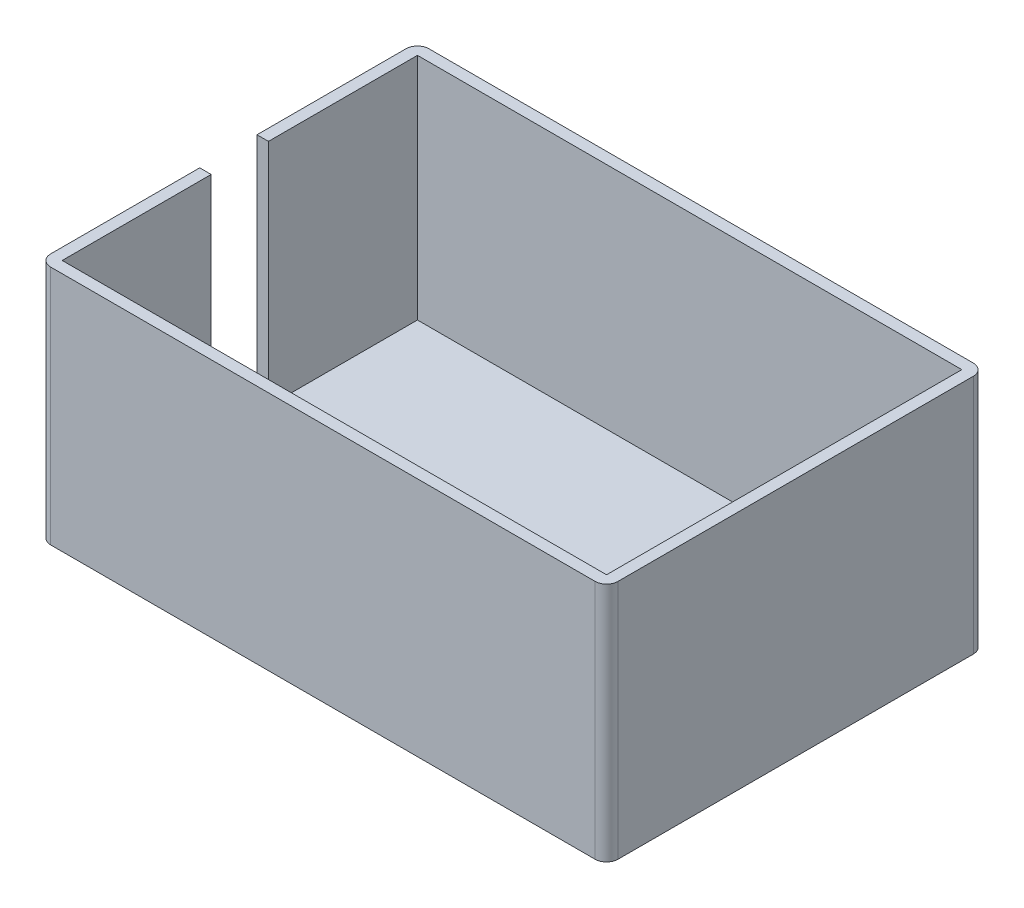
ISO-10303-21;
HEADER;
FILE_DESCRIPTION(('STEP AP214'),'2;1');
FILE_NAME('part.step','',(''),(''),'','','');
FILE_SCHEMA(('AUTOMOTIVE_DESIGN { 1 0 10303 214 1 1 1 1 }'));
ENDSEC;
DATA;
#1=APPLICATION_CONTEXT('core data for automotive mechanical design processes');
#2=APPLICATION_PROTOCOL_DEFINITION('international standard','automotive_design',2000,#1);
#3=PRODUCT_CONTEXT('',#1,'mechanical');
#4=PRODUCT('Part','Part','',(#3));
#5=PRODUCT_RELATED_PRODUCT_CATEGORY('part','',(#4));
#6=PRODUCT_DEFINITION_FORMATION('','',#4);
#7=PRODUCT_DEFINITION_CONTEXT('part definition',#1,'design');
#8=PRODUCT_DEFINITION('design','',#6,#7);
#9=PRODUCT_DEFINITION_SHAPE('','',#8);
#10=(LENGTH_UNIT() NAMED_UNIT(*) SI_UNIT(.MILLI.,.METRE.));
#11=(NAMED_UNIT(*) PLANE_ANGLE_UNIT() SI_UNIT($,.RADIAN.));
#12=(NAMED_UNIT(*) SI_UNIT($,.STERADIAN.) SOLID_ANGLE_UNIT());
#13=UNCERTAINTY_MEASURE_WITH_UNIT(LENGTH_MEASURE(1.E-05),#10,'distance_accuracy_value','');
#14=(GEOMETRIC_REPRESENTATION_CONTEXT(3) GLOBAL_UNCERTAINTY_ASSIGNED_CONTEXT((#13)) GLOBAL_UNIT_ASSIGNED_CONTEXT((#10,
#11,#12)) REPRESENTATION_CONTEXT('',''));
#15=CARTESIAN_POINT('',(0.,0.,0.));
#16=DIRECTION('',(0.,0.,1.));
#17=DIRECTION('',(1.,0.,0.));
#18=AXIS2_PLACEMENT_3D('',#15,#16,#17);
#19=CARTESIAN_POINT('',(-49.5,21.,-66.));
#20=DIRECTION('',(0.,1.,0.));
#21=DIRECTION('',(0.,0.,1.));
#22=AXIS2_PLACEMENT_3D('',#19,#20,#21);
#23=PLANE('',#22);
#24=DIRECTION('',(-1.,0.,0.));
#25=VECTOR('',#24,1.);
#26=CARTESIAN_POINT('',(-49.5,21.,-66.));
#27=LINE('',#26,#25);
#28=CARTESIAN_POINT('',(47.5,21.,-66.));
#29=VERTEX_POINT('',#28);
#30=CARTESIAN_POINT('',(-47.5,21.,-66.));
#31=VERTEX_POINT('',#30);
#32=EDGE_CURVE('E188',#29,#31,#27,.T.);
#33=ORIENTED_EDGE('',*,*,#32,.T.);
#34=CARTESIAN_POINT('',(-47.5,21.,-64.));
#35=DIRECTION('',(0.,1.,0.));
#36=DIRECTION('',(0.,0.,1.));
#37=AXIS2_PLACEMENT_3D('',#34,#35,#36);
#38=CIRCLE('',#37,2.);
#39=CARTESIAN_POINT('',(-49.5,21.,-64.));
#40=VERTEX_POINT('',#39);
#41=EDGE_CURVE('E216',#31,#40,#38,.T.);
#42=ORIENTED_EDGE('',*,*,#41,.T.);
#43=DIRECTION('',(0.,0.,1.));
#44=VECTOR('',#43,1.);
#45=CARTESIAN_POINT('',(-49.5,21.,-66.));
#46=LINE('',#45,#44);
#47=CARTESIAN_POINT('',(-49.5,21.,-38.));
#48=VERTEX_POINT('',#47);
#49=EDGE_CURVE('E174',#40,#48,#46,.T.);
#50=ORIENTED_EDGE('',*,*,#49,.T.);
#51=DIRECTION('',(-1.,0.,0.));
#52=VECTOR('',#51,1.);
#53=CARTESIAN_POINT('',(-39.5,21.,-38.));
#54=LINE('',#53,#52);
#55=CARTESIAN_POINT('',(-47.5,21.,-38.));
#56=VERTEX_POINT('',#55);
#57=EDGE_CURVE('E273',#56,#48,#54,.T.);
#58=ORIENTED_EDGE('',*,*,#57,.F.);
#59=DIRECTION('',(0.,0.,1.));
#60=VECTOR('',#59,1.);
#61=CARTESIAN_POINT('',(-47.5,21.,-66.));
#62=LINE('',#61,#60);
#63=CARTESIAN_POINT('',(-47.5,21.,-64.));
#64=VERTEX_POINT('',#63);
#65=EDGE_CURVE('E235',#64,#56,#62,.T.);
#66=ORIENTED_EDGE('',*,*,#65,.F.);
#67=DIRECTION('',(-1.,0.,0.));
#68=VECTOR('',#67,1.);
#69=CARTESIAN_POINT('',(0.,21.,-64.));
#70=LINE('',#69,#68);
#71=CARTESIAN_POINT('',(47.5,21.,-64.));
#72=VERTEX_POINT('',#71);
#73=EDGE_CURVE('E243',#72,#64,#70,.T.);
#74=ORIENTED_EDGE('',*,*,#73,.F.);
#75=DIRECTION('',(0.,0.,1.));
#76=VECTOR('',#75,1.);
#77=CARTESIAN_POINT('',(47.5,21.,-66.));
#78=LINE('',#77,#76);
#79=CARTESIAN_POINT('',(47.5,21.,-2.));
#80=VERTEX_POINT('',#79);
#81=EDGE_CURVE('E247',#72,#80,#78,.T.);
#82=ORIENTED_EDGE('',*,*,#81,.T.);
#83=DIRECTION('',(-1.,0.,0.));
#84=VECTOR('',#83,1.);
#85=CARTESIAN_POINT('',(0.,21.,-2.));
#86=LINE('',#85,#84);
#87=CARTESIAN_POINT('',(-47.5,21.,-2.));
#88=VERTEX_POINT('',#87);
#89=EDGE_CURVE('E251',#80,#88,#86,.T.);
#90=ORIENTED_EDGE('',*,*,#89,.T.);
#91=CARTESIAN_POINT('',(-47.5,21.,-28.));
#92=VERTEX_POINT('',#91);
#93=EDGE_CURVE('E166',#92,#88,#62,.T.);
#94=ORIENTED_EDGE('',*,*,#93,.F.);
#95=DIRECTION('',(-1.,0.,0.));
#96=VECTOR('',#95,1.);
#97=CARTESIAN_POINT('',(-39.5,21.,-28.));
#98=LINE('',#97,#96);
#99=CARTESIAN_POINT('',(-49.5,21.,-28.));
#100=VERTEX_POINT('',#99);
#101=EDGE_CURVE('E150',#92,#100,#98,.T.);
#102=ORIENTED_EDGE('',*,*,#101,.T.);
#103=CARTESIAN_POINT('',(-49.5,21.,-2.));
#104=VERTEX_POINT('',#103);
#105=EDGE_CURVE('E163',#100,#104,#46,.T.);
#106=ORIENTED_EDGE('',*,*,#105,.T.);
#107=CARTESIAN_POINT('',(-47.5,21.,-2.));
#108=DIRECTION('',(0.,1.,0.));
#109=DIRECTION('',(0.,0.,1.));
#110=AXIS2_PLACEMENT_3D('',#107,#108,#109);
#111=CIRCLE('',#110,2.);
#112=CARTESIAN_POINT('',(-47.5,21.,0.));
#113=VERTEX_POINT('',#112);
#114=EDGE_CURVE('E212',#104,#113,#111,.T.);
#115=ORIENTED_EDGE('',*,*,#114,.T.);
#116=DIRECTION('',(-1.,0.,0.));
#117=VECTOR('',#116,1.);
#118=CARTESIAN_POINT('',(-49.5,21.,0.));
#119=LINE('',#118,#117);
#120=CARTESIAN_POINT('',(47.5,21.,0.));
#121=VERTEX_POINT('',#120);
#122=EDGE_CURVE('E181',#121,#113,#119,.T.);
#123=ORIENTED_EDGE('',*,*,#122,.F.);
#124=CARTESIAN_POINT('',(47.5,21.,-2.));
#125=DIRECTION('',(0.,1.,0.));
#126=DIRECTION('',(0.,0.,1.));
#127=AXIS2_PLACEMENT_3D('',#124,#125,#126);
#128=CIRCLE('',#127,2.);
#129=CARTESIAN_POINT('',(49.5,21.,-2.));
#130=VERTEX_POINT('',#129);
#131=EDGE_CURVE('E48',#121,#130,#128,.T.);
#132=ORIENTED_EDGE('',*,*,#131,.T.);
#133=DIRECTION('',(0.,0.,1.));
#134=VECTOR('',#133,1.);
#135=CARTESIAN_POINT('',(49.5,21.,-66.));
#136=LINE('',#135,#134);
#137=CARTESIAN_POINT('',(49.5,21.,-64.));
#138=VERTEX_POINT('',#137);
#139=EDGE_CURVE('E175',#138,#130,#136,.T.);
#140=ORIENTED_EDGE('',*,*,#139,.F.);
#141=CARTESIAN_POINT('',(47.5,21.,-64.));
#142=DIRECTION('',(0.,1.,0.));
#143=DIRECTION('',(0.,0.,1.));
#144=AXIS2_PLACEMENT_3D('',#141,#142,#143);
#145=CIRCLE('',#144,2.);
#146=EDGE_CURVE('E56',#138,#29,#145,.T.);
#147=ORIENTED_EDGE('',*,*,#146,.T.);
#148=EDGE_LOOP('',(#33,#42,#50,#58,#66,#74,#82,#90,#94,#102,#106,#115,#123,#132,#140,#147));
#149=FACE_BOUND('',#148,.T.);
#150=ADVANCED_FACE('F33',(#149),#23,.T.);
#151=CARTESIAN_POINT('',(-49.5,21.,-66.));
#152=DIRECTION('',(-1.,0.,0.));
#153=DIRECTION('',(0.,0.,1.));
#154=AXIS2_PLACEMENT_3D('',#151,#152,#153);
#155=PLANE('',#154);
#156=ORIENTED_EDGE('',*,*,#49,.F.);
#157=DIRECTION('',(0.,-1.,0.));
#158=VECTOR('',#157,1.);
#159=CARTESIAN_POINT('',(-49.5,-21.,-64.));
#160=LINE('',#159,#158);
#161=CARTESIAN_POINT('',(-49.5,-21.,-64.));
#162=VERTEX_POINT('',#161);
#163=EDGE_CURVE('E197',#40,#162,#160,.T.);
#164=ORIENTED_EDGE('',*,*,#163,.T.);
#165=DIRECTION('',(0.,0.,1.));
#166=VECTOR('',#165,1.);
#167=CARTESIAN_POINT('',(-49.5,-21.,-66.));
#168=LINE('',#167,#166);
#169=CARTESIAN_POINT('',(-49.5,-21.,-2.));
#170=VERTEX_POINT('',#169);
#171=EDGE_CURVE('E186',#162,#170,#168,.T.);
#172=ORIENTED_EDGE('',*,*,#171,.T.);
#173=DIRECTION('',(0.,-1.,0.));
#174=VECTOR('',#173,1.);
#175=CARTESIAN_POINT('',(-49.5,21.,-2.));
#176=LINE('',#175,#174);
#177=EDGE_CURVE('E173',#170,#104,#176,.F.);
#178=ORIENTED_EDGE('',*,*,#177,.T.);
#179=ORIENTED_EDGE('',*,*,#105,.F.);
#180=DIRECTION('',(0.,-1.,0.));
#181=VECTOR('',#180,1.);
#182=CARTESIAN_POINT('',(-49.5,21.,-28.));
#183=LINE('',#182,#181);
#184=CARTESIAN_POINT('',(-49.5,-18.5619536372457,-28.));
#185=VERTEX_POINT('',#184);
#186=EDGE_CURVE('E147',#100,#185,#183,.T.);
#187=ORIENTED_EDGE('',*,*,#186,.T.);
#188=DIRECTION('',(0.,0.,1.));
#189=VECTOR('',#188,1.);
#190=CARTESIAN_POINT('',(-49.5,-18.5619536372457,-38.));
#191=LINE('',#190,#189);
#192=CARTESIAN_POINT('',(-49.5,-18.5619536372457,-38.));
#193=VERTEX_POINT('',#192);
#194=EDGE_CURVE('E158',#193,#185,#191,.T.);
#195=ORIENTED_EDGE('',*,*,#194,.F.);
#196=DIRECTION('',(0.,-1.,0.));
#197=VECTOR('',#196,1.);
#198=CARTESIAN_POINT('',(-49.5,21.,-38.));
#199=LINE('',#198,#197);
#200=EDGE_CURVE('E276',#48,#193,#199,.T.);
#201=ORIENTED_EDGE('',*,*,#200,.F.);
#202=EDGE_LOOP('',(#156,#164,#172,#178,#179,#187,#195,#201));
#203=FACE_BOUND('',#202,.T.);
#204=ADVANCED_FACE('F170',(#203),#155,.T.);
#205=CARTESIAN_POINT('',(-47.5,21.,-66.));
#206=DIRECTION('',(-1.,0.,0.));
#207=DIRECTION('',(0.,0.,1.));
#208=AXIS2_PLACEMENT_3D('',#205,#206,#207);
#209=PLANE('',#208);
#210=DIRECTION('',(0.,-1.,0.));
#211=VECTOR('',#210,1.);
#212=CARTESIAN_POINT('',(-47.5,21.,-28.));
#213=LINE('',#212,#211);
#214=CARTESIAN_POINT('',(-47.5,-18.5619536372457,-28.));
#215=VERTEX_POINT('',#214);
#216=EDGE_CURVE('E194',#92,#215,#213,.T.);
#217=ORIENTED_EDGE('',*,*,#216,.F.);
#218=ORIENTED_EDGE('',*,*,#93,.T.);
#219=DIRECTION('',(0.,-1.,0.));
#220=VECTOR('',#219,1.);
#221=CARTESIAN_POINT('',(-47.5,0.,-2.));
#222=LINE('',#221,#220);
#223=CARTESIAN_POINT('',(-47.5,-19.,-2.));
#224=VERTEX_POINT('',#223);
#225=EDGE_CURVE('E167',#88,#224,#222,.T.);
#226=ORIENTED_EDGE('',*,*,#225,.T.);
#227=DIRECTION('',(0.,0.,1.));
#228=VECTOR('',#227,1.);
#229=CARTESIAN_POINT('',(-47.5,-19.,-66.));
#230=LINE('',#229,#228);
#231=CARTESIAN_POINT('',(-47.5,-19.,-64.));
#232=VERTEX_POINT('',#231);
#233=EDGE_CURVE('E245',#232,#224,#230,.T.);
#234=ORIENTED_EDGE('',*,*,#233,.F.);
#235=DIRECTION('',(0.,-1.,0.));
#236=VECTOR('',#235,1.);
#237=CARTESIAN_POINT('',(-47.5,0.,-64.));
#238=LINE('',#237,#236);
#239=EDGE_CURVE('E252',#64,#232,#238,.T.);
#240=ORIENTED_EDGE('',*,*,#239,.F.);
#241=ORIENTED_EDGE('',*,*,#65,.T.);
#242=DIRECTION('',(0.,-1.,0.));
#243=VECTOR('',#242,1.);
#244=CARTESIAN_POINT('',(-47.5,21.,-38.));
#245=LINE('',#244,#243);
#246=CARTESIAN_POINT('',(-47.5,-18.5619536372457,-38.));
#247=VERTEX_POINT('',#246);
#248=EDGE_CURVE('E177',#56,#247,#245,.T.);
#249=ORIENTED_EDGE('',*,*,#248,.T.);
#250=DIRECTION('',(0.,0.,1.));
#251=VECTOR('',#250,1.);
#252=CARTESIAN_POINT('',(-47.5,-18.5619536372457,-66.));
#253=LINE('',#252,#251);
#254=EDGE_CURVE('E191',#247,#215,#253,.T.);
#255=ORIENTED_EDGE('',*,*,#254,.T.);
#256=EDGE_LOOP('',(#217,#218,#226,#234,#240,#241,#249,#255));
#257=FACE_BOUND('',#256,.T.);
#258=ADVANCED_FACE('F291',(#257),#209,.F.);
#259=CARTESIAN_POINT('',(49.5,21.,-66.));
#260=DIRECTION('',(1.,0.,0.));
#261=DIRECTION('',(0.,0.,-1.));
#262=AXIS2_PLACEMENT_3D('',#259,#260,#261);
#263=PLANE('',#262);
#264=DIRECTION('',(0.,0.,1.));
#265=VECTOR('',#264,1.);
#266=CARTESIAN_POINT('',(49.5,-21.,-66.));
#267=LINE('',#266,#265);
#268=CARTESIAN_POINT('',(49.5,-21.,-64.));
#269=VERTEX_POINT('',#268);
#270=CARTESIAN_POINT('',(49.5,-21.,-2.));
#271=VERTEX_POINT('',#270);
#272=EDGE_CURVE('E178',#269,#271,#267,.T.);
#273=ORIENTED_EDGE('',*,*,#272,.F.);
#274=DIRECTION('',(0.,1.,0.));
#275=VECTOR('',#274,1.);
#276=CARTESIAN_POINT('',(49.5,21.,-64.));
#277=LINE('',#276,#275);
#278=EDGE_CURVE('E220',#269,#138,#277,.T.);
#279=ORIENTED_EDGE('',*,*,#278,.T.);
#280=ORIENTED_EDGE('',*,*,#139,.T.);
#281=DIRECTION('',(0.,1.,0.));
#282=VECTOR('',#281,1.);
#283=CARTESIAN_POINT('',(49.5,21.,-2.));
#284=LINE('',#283,#282);
#285=EDGE_CURVE('E218',#130,#271,#284,.F.);
#286=ORIENTED_EDGE('',*,*,#285,.T.);
#287=EDGE_LOOP('',(#273,#279,#280,#286));
#288=FACE_BOUND('',#287,.T.);
#289=ADVANCED_FACE('F323',(#288),#263,.T.);
#290=CARTESIAN_POINT('',(-49.5,-21.,-66.));
#291=DIRECTION('',(0.,-1.,0.));
#292=DIRECTION('',(0.,0.,-1.));
#293=AXIS2_PLACEMENT_3D('',#290,#291,#292);
#294=PLANE('',#293);
#295=ORIENTED_EDGE('',*,*,#171,.F.);
#296=CARTESIAN_POINT('',(-47.5,-21.,-64.));
#297=DIRECTION('',(0.,-1.,0.));
#298=DIRECTION('',(0.,0.,-1.));
#299=AXIS2_PLACEMENT_3D('',#296,#297,#298);
#300=CIRCLE('',#299,2.);
#301=CARTESIAN_POINT('',(-47.5,-21.,-66.));
#302=VERTEX_POINT('',#301);
#303=EDGE_CURVE('E206',#162,#302,#300,.T.);
#304=ORIENTED_EDGE('',*,*,#303,.T.);
#305=DIRECTION('',(1.,0.,0.));
#306=VECTOR('',#305,1.);
#307=CARTESIAN_POINT('',(-49.5,-21.,-66.));
#308=LINE('',#307,#306);
#309=CARTESIAN_POINT('',(47.5,-21.,-66.));
#310=VERTEX_POINT('',#309);
#311=EDGE_CURVE('E236',#302,#310,#308,.T.);
#312=ORIENTED_EDGE('',*,*,#311,.T.);
#313=CARTESIAN_POINT('',(47.5,-21.,-64.));
#314=DIRECTION('',(0.,-1.,0.));
#315=DIRECTION('',(0.,0.,-1.));
#316=AXIS2_PLACEMENT_3D('',#313,#314,#315);
#317=CIRCLE('',#316,2.);
#318=EDGE_CURVE('E204',#310,#269,#317,.T.);
#319=ORIENTED_EDGE('',*,*,#318,.T.);
#320=ORIENTED_EDGE('',*,*,#272,.T.);
#321=CARTESIAN_POINT('',(47.5,-21.,-2.));
#322=DIRECTION('',(0.,-1.,0.));
#323=DIRECTION('',(0.,0.,-1.));
#324=AXIS2_PLACEMENT_3D('',#321,#322,#323);
#325=CIRCLE('',#324,2.);
#326=CARTESIAN_POINT('',(47.5,-21.,0.));
#327=VERTEX_POINT('',#326);
#328=EDGE_CURVE('E202',#271,#327,#325,.T.);
#329=ORIENTED_EDGE('',*,*,#328,.T.);
#330=DIRECTION('',(1.,0.,0.));
#331=VECTOR('',#330,1.);
#332=CARTESIAN_POINT('',(-49.5,-21.,0.));
#333=LINE('',#332,#331);
#334=CARTESIAN_POINT('',(-47.5,-21.,0.));
#335=VERTEX_POINT('',#334);
#336=EDGE_CURVE('E228',#335,#327,#333,.T.);
#337=ORIENTED_EDGE('',*,*,#336,.F.);
#338=CARTESIAN_POINT('',(-47.5,-21.,-2.));
#339=DIRECTION('',(0.,-1.,0.));
#340=DIRECTION('',(0.,0.,-1.));
#341=AXIS2_PLACEMENT_3D('',#338,#339,#340);
#342=CIRCLE('',#341,2.);
#343=EDGE_CURVE('E200',#335,#170,#342,.T.);
#344=ORIENTED_EDGE('',*,*,#343,.T.);
#345=EDGE_LOOP('',(#295,#304,#312,#319,#320,#329,#337,#344));
#346=FACE_BOUND('',#345,.T.);
#347=ADVANCED_FACE('F233',(#346),#294,.T.);
#348=CARTESIAN_POINT('',(0.,0.,-66.));
#349=DIRECTION('',(0.,0.,1.));
#350=DIRECTION('',(1.,0.,0.));
#351=AXIS2_PLACEMENT_3D('',#348,#349,#350);
#352=PLANE('',#351);
#353=ORIENTED_EDGE('',*,*,#311,.F.);
#354=DIRECTION('',(0.,-1.,0.));
#355=VECTOR('',#354,1.);
#356=CARTESIAN_POINT('',(-47.5,21.,-66.));
#357=LINE('',#356,#355);
#358=EDGE_CURVE('E210',#302,#31,#357,.F.);
#359=ORIENTED_EDGE('',*,*,#358,.T.);
#360=ORIENTED_EDGE('',*,*,#32,.F.);
#361=DIRECTION('',(0.,1.,0.));
#362=VECTOR('',#361,1.);
#363=CARTESIAN_POINT('',(47.5,-21.,-66.));
#364=LINE('',#363,#362);
#365=EDGE_CURVE('E208',#29,#310,#364,.F.);
#366=ORIENTED_EDGE('',*,*,#365,.T.);
#367=EDGE_LOOP('',(#353,#359,#360,#366));
#368=FACE_BOUND('',#367,.T.);
#369=ADVANCED_FACE('F328',(#368),#352,.F.);
#370=CARTESIAN_POINT('',(0.,0.,0.));
#371=DIRECTION('',(0.,0.,1.));
#372=DIRECTION('',(1.,0.,0.));
#373=AXIS2_PLACEMENT_3D('',#370,#371,#372);
#374=PLANE('',#373);
#375=ORIENTED_EDGE('',*,*,#336,.T.);
#376=DIRECTION('',(0.,1.,0.));
#377=VECTOR('',#376,1.);
#378=CARTESIAN_POINT('',(47.5,0.,0.));
#379=LINE('',#378,#377);
#380=EDGE_CURVE('E11',#327,#121,#379,.T.);
#381=ORIENTED_EDGE('',*,*,#380,.T.);
#382=ORIENTED_EDGE('',*,*,#122,.T.);
#383=DIRECTION('',(0.,-1.,0.));
#384=VECTOR('',#383,1.);
#385=CARTESIAN_POINT('',(-47.5,0.,0.));
#386=LINE('',#385,#384);
#387=EDGE_CURVE('E41',#113,#335,#386,.T.);
#388=ORIENTED_EDGE('',*,*,#387,.T.);
#389=EDGE_LOOP('',(#375,#381,#382,#388));
#390=FACE_BOUND('',#389,.T.);
#391=ADVANCED_FACE('F227',(#390),#374,.T.);
#392=CARTESIAN_POINT('',(47.5,21.,-66.));
#393=DIRECTION('',(1.,0.,0.));
#394=DIRECTION('',(0.,0.,-1.));
#395=AXIS2_PLACEMENT_3D('',#392,#393,#394);
#396=PLANE('',#395);
#397=DIRECTION('',(0.,1.,0.));
#398=VECTOR('',#397,1.);
#399=CARTESIAN_POINT('',(47.5,0.,-2.));
#400=LINE('',#399,#398);
#401=CARTESIAN_POINT('',(47.5,-19.,-2.));
#402=VERTEX_POINT('',#401);
#403=EDGE_CURVE('E253',#402,#80,#400,.T.);
#404=ORIENTED_EDGE('',*,*,#403,.T.);
#405=ORIENTED_EDGE('',*,*,#81,.F.);
#406=DIRECTION('',(0.,1.,0.));
#407=VECTOR('',#406,1.);
#408=CARTESIAN_POINT('',(47.5,0.,-64.));
#409=LINE('',#408,#407);
#410=CARTESIAN_POINT('',(47.5,-19.,-64.));
#411=VERTEX_POINT('',#410);
#412=EDGE_CURVE('E246',#411,#72,#409,.T.);
#413=ORIENTED_EDGE('',*,*,#412,.F.);
#414=DIRECTION('',(0.,0.,1.));
#415=VECTOR('',#414,1.);
#416=CARTESIAN_POINT('',(47.5,-19.,-66.));
#417=LINE('',#416,#415);
#418=EDGE_CURVE('E250',#411,#402,#417,.T.);
#419=ORIENTED_EDGE('',*,*,#418,.T.);
#420=EDGE_LOOP('',(#404,#405,#413,#419));
#421=FACE_BOUND('',#420,.T.);
#422=ADVANCED_FACE('F298',(#421),#396,.F.);
#423=CARTESIAN_POINT('',(-49.5,-19.,-66.));
#424=DIRECTION('',(0.,-1.,0.));
#425=DIRECTION('',(0.,0.,-1.));
#426=AXIS2_PLACEMENT_3D('',#423,#424,#425);
#427=PLANE('',#426);
#428=DIRECTION('',(1.,0.,0.));
#429=VECTOR('',#428,1.);
#430=CARTESIAN_POINT('',(0.,-19.,-2.));
#431=LINE('',#430,#429);
#432=EDGE_CURVE('E259',#224,#402,#431,.T.);
#433=ORIENTED_EDGE('',*,*,#432,.T.);
#434=ORIENTED_EDGE('',*,*,#418,.F.);
#435=DIRECTION('',(1.,0.,0.));
#436=VECTOR('',#435,1.);
#437=CARTESIAN_POINT('',(0.,-19.,-64.));
#438=LINE('',#437,#436);
#439=EDGE_CURVE('E257',#232,#411,#438,.T.);
#440=ORIENTED_EDGE('',*,*,#439,.F.);
#441=ORIENTED_EDGE('',*,*,#233,.T.);
#442=EDGE_LOOP('',(#433,#434,#440,#441));
#443=FACE_BOUND('',#442,.T.);
#444=ADVANCED_FACE('F305',(#443),#427,.F.);
#445=CARTESIAN_POINT('',(0.,0.,-64.));
#446=DIRECTION('',(0.,0.,1.));
#447=DIRECTION('',(1.,0.,0.));
#448=AXIS2_PLACEMENT_3D('',#445,#446,#447);
#449=PLANE('',#448);
#450=ORIENTED_EDGE('',*,*,#239,.T.);
#451=ORIENTED_EDGE('',*,*,#439,.T.);
#452=ORIENTED_EDGE('',*,*,#412,.T.);
#453=ORIENTED_EDGE('',*,*,#73,.T.);
#454=EDGE_LOOP('',(#450,#451,#452,#453));
#455=FACE_BOUND('',#454,.T.);
#456=ADVANCED_FACE('F294',(#455),#449,.T.);
#457=CARTESIAN_POINT('',(0.,0.,-2.));
#458=DIRECTION('',(0.,0.,1.));
#459=DIRECTION('',(1.,0.,0.));
#460=AXIS2_PLACEMENT_3D('',#457,#458,#459);
#461=PLANE('',#460);
#462=ORIENTED_EDGE('',*,*,#225,.F.);
#463=ORIENTED_EDGE('',*,*,#89,.F.);
#464=ORIENTED_EDGE('',*,*,#403,.F.);
#465=ORIENTED_EDGE('',*,*,#432,.F.);
#466=EDGE_LOOP('',(#462,#463,#464,#465));
#467=FACE_BOUND('',#466,.T.);
#468=ADVANCED_FACE('F303',(#467),#461,.F.);
#469=CARTESIAN_POINT('',(-39.5,21.,-28.));
#470=DIRECTION('',(0.,0.,-1.));
#471=DIRECTION('',(-1.,0.,0.));
#472=AXIS2_PLACEMENT_3D('',#469,#470,#471);
#473=PLANE('',#472);
#474=ORIENTED_EDGE('',*,*,#216,.T.);
#475=DIRECTION('',(-1.,0.,0.));
#476=VECTOR('',#475,1.);
#477=CARTESIAN_POINT('',(-39.5,-18.5619536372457,-28.));
#478=LINE('',#477,#476);
#479=EDGE_CURVE('E153',#215,#185,#478,.T.);
#480=ORIENTED_EDGE('',*,*,#479,.T.);
#481=ORIENTED_EDGE('',*,*,#186,.F.);
#482=ORIENTED_EDGE('',*,*,#101,.F.);
#483=EDGE_LOOP('',(#474,#480,#481,#482));
#484=FACE_BOUND('',#483,.T.);
#485=ADVANCED_FACE('F149',(#484),#473,.T.);
#486=CARTESIAN_POINT('',(-39.5,-18.5619536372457,-38.));
#487=DIRECTION('',(0.,-1.,0.));
#488=DIRECTION('',(0.,0.,-1.));
#489=AXIS2_PLACEMENT_3D('',#486,#487,#488);
#490=PLANE('',#489);
#491=DIRECTION('',(-1.,0.,0.));
#492=VECTOR('',#491,1.);
#493=CARTESIAN_POINT('',(-39.5,-18.5619536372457,-38.));
#494=LINE('',#493,#492);
#495=EDGE_CURVE('E271',#247,#193,#494,.T.);
#496=ORIENTED_EDGE('',*,*,#495,.T.);
#497=ORIENTED_EDGE('',*,*,#194,.T.);
#498=ORIENTED_EDGE('',*,*,#479,.F.);
#499=ORIENTED_EDGE('',*,*,#254,.F.);
#500=EDGE_LOOP('',(#496,#497,#498,#499));
#501=FACE_BOUND('',#500,.T.);
#502=ADVANCED_FACE('F280',(#501),#490,.F.);
#503=CARTESIAN_POINT('',(-39.5,21.,-38.));
#504=DIRECTION('',(0.,0.,-1.));
#505=DIRECTION('',(-1.,0.,0.));
#506=AXIS2_PLACEMENT_3D('',#503,#504,#505);
#507=PLANE('',#506);
#508=ORIENTED_EDGE('',*,*,#57,.T.);
#509=ORIENTED_EDGE('',*,*,#200,.T.);
#510=ORIENTED_EDGE('',*,*,#495,.F.);
#511=ORIENTED_EDGE('',*,*,#248,.F.);
#512=EDGE_LOOP('',(#508,#509,#510,#511));
#513=FACE_BOUND('',#512,.T.);
#514=ADVANCED_FACE('F285',(#513),#507,.F.);
#515=CARTESIAN_POINT('',(-47.5,21.,-64.));
#516=DIRECTION('',(0.,1.,0.));
#517=DIRECTION('',(0.,0.,1.));
#518=AXIS2_PLACEMENT_3D('',#515,#516,#517);
#519=CYLINDRICAL_SURFACE('',#518,2.);
#520=ORIENTED_EDGE('',*,*,#41,.F.);
#521=ORIENTED_EDGE('',*,*,#358,.F.);
#522=ORIENTED_EDGE('',*,*,#303,.F.);
#523=ORIENTED_EDGE('',*,*,#163,.F.);
#524=EDGE_LOOP('',(#520,#521,#522,#523));
#525=FACE_BOUND('',#524,.T.);
#526=ADVANCED_FACE('F330',(#525),#519,.T.);
#527=CARTESIAN_POINT('',(47.5,21.,-64.));
#528=DIRECTION('',(0.,-1.,0.));
#529=DIRECTION('',(0.,0.,-1.));
#530=AXIS2_PLACEMENT_3D('',#527,#528,#529);
#531=CYLINDRICAL_SURFACE('',#530,2.);
#532=ORIENTED_EDGE('',*,*,#318,.F.);
#533=ORIENTED_EDGE('',*,*,#365,.F.);
#534=ORIENTED_EDGE('',*,*,#146,.F.);
#535=ORIENTED_EDGE('',*,*,#278,.F.);
#536=EDGE_LOOP('',(#532,#533,#534,#535));
#537=FACE_BOUND('',#536,.T.);
#538=ADVANCED_FACE('F333',(#537),#531,.T.);
#539=CARTESIAN_POINT('',(47.5,0.,-2.));
#540=DIRECTION('',(0.,1.,0.));
#541=DIRECTION('',(0.,0.,1.));
#542=AXIS2_PLACEMENT_3D('',#539,#540,#541);
#543=CYLINDRICAL_SURFACE('',#542,2.);
#544=ORIENTED_EDGE('',*,*,#328,.F.);
#545=ORIENTED_EDGE('',*,*,#285,.F.);
#546=ORIENTED_EDGE('',*,*,#131,.F.);
#547=ORIENTED_EDGE('',*,*,#380,.F.);
#548=EDGE_LOOP('',(#544,#545,#546,#547));
#549=FACE_BOUND('',#548,.T.);
#550=ADVANCED_FACE('F336',(#549),#543,.T.);
#551=CARTESIAN_POINT('',(-47.5,0.,-2.));
#552=DIRECTION('',(0.,-1.,0.));
#553=DIRECTION('',(0.,0.,-1.));
#554=AXIS2_PLACEMENT_3D('',#551,#552,#553);
#555=CYLINDRICAL_SURFACE('',#554,2.);
#556=ORIENTED_EDGE('',*,*,#114,.F.);
#557=ORIENTED_EDGE('',*,*,#177,.F.);
#558=ORIENTED_EDGE('',*,*,#343,.F.);
#559=ORIENTED_EDGE('',*,*,#387,.F.);
#560=EDGE_LOOP('',(#556,#557,#558,#559));
#561=FACE_BOUND('',#560,.T.);
#562=ADVANCED_FACE('F35',(#561),#555,.T.);
#563=CLOSED_SHELL('',(#150,#204,#258,#289,#347,#369,#391,#422,#444,#456,#468,#485,#502,#514,
#526,#538,#550,#562));
#564=MANIFOLD_SOLID_BREP('B2',#563);
#565=ADVANCED_BREP_SHAPE_REPRESENTATION('',(#18,#564),#14);
#566=SHAPE_DEFINITION_REPRESENTATION(#9,#565);
ENDSEC;
END-ISO-10303-21;
